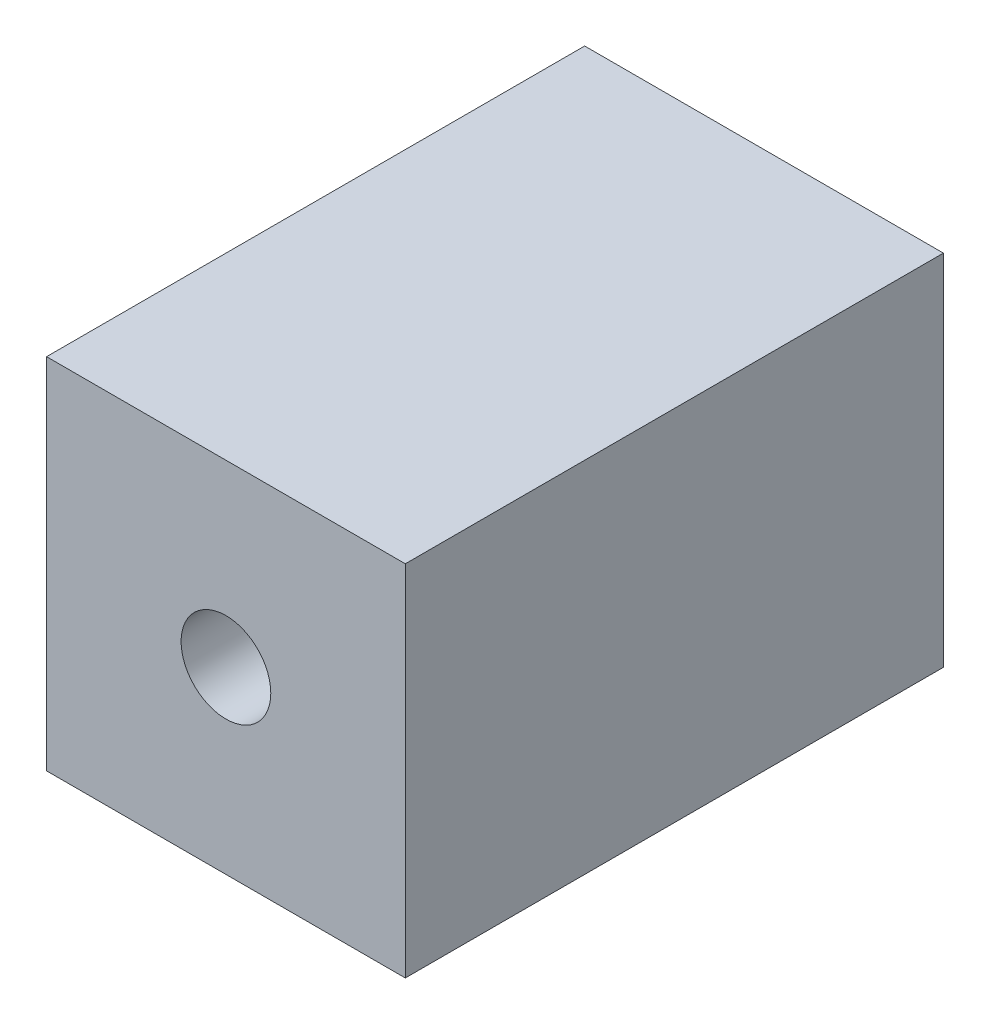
ISO-10303-21;
HEADER;
FILE_DESCRIPTION(('STEP AP214'),'2;1');
FILE_NAME('part.step','',(''),(''),'','','');
FILE_SCHEMA(('AUTOMOTIVE_DESIGN { 1 0 10303 214 1 1 1 1 }'));
ENDSEC;
DATA;
#1=APPLICATION_CONTEXT('core data for automotive mechanical design processes');
#2=APPLICATION_PROTOCOL_DEFINITION('international standard','automotive_design',2000,#1);
#3=PRODUCT_CONTEXT('',#1,'mechanical');
#4=PRODUCT('Part','Part','',(#3));
#5=PRODUCT_RELATED_PRODUCT_CATEGORY('part','',(#4));
#6=PRODUCT_DEFINITION_FORMATION('','',#4);
#7=PRODUCT_DEFINITION_CONTEXT('part definition',#1,'design');
#8=PRODUCT_DEFINITION('design','',#6,#7);
#9=PRODUCT_DEFINITION_SHAPE('','',#8);
#10=(LENGTH_UNIT() NAMED_UNIT(*) SI_UNIT(.MILLI.,.METRE.));
#11=(NAMED_UNIT(*) PLANE_ANGLE_UNIT() SI_UNIT($,.RADIAN.));
#12=(NAMED_UNIT(*) SI_UNIT($,.STERADIAN.) SOLID_ANGLE_UNIT());
#13=UNCERTAINTY_MEASURE_WITH_UNIT(LENGTH_MEASURE(1.E-05),#10,'distance_accuracy_value','');
#14=(GEOMETRIC_REPRESENTATION_CONTEXT(3) GLOBAL_UNCERTAINTY_ASSIGNED_CONTEXT((#13)) GLOBAL_UNIT_ASSIGNED_CONTEXT((#10,
#11,#12)) REPRESENTATION_CONTEXT('',''));
#15=CARTESIAN_POINT('',(0.,0.,0.));
#16=DIRECTION('',(0.,0.,1.));
#17=DIRECTION('',(1.,0.,0.));
#18=AXIS2_PLACEMENT_3D('',#15,#16,#17);
#19=CARTESIAN_POINT('',(0.,0.,30.));
#20=DIRECTION('',(1.,0.,0.));
#21=DIRECTION('',(0.,1.,0.));
#22=AXIS2_PLACEMENT_3D('',#19,#20,#21);
#23=PLANE('',#22);
#24=DIRECTION('',(0.,-1.,0.));
#25=VECTOR('',#24,1.);
#26=CARTESIAN_POINT('',(0.,0.,0.));
#27=LINE('',#26,#25);
#28=CARTESIAN_POINT('',(0.,0.,0.));
#29=VERTEX_POINT('',#28);
#30=CARTESIAN_POINT('',(0.,-20.,0.));
#31=VERTEX_POINT('',#30);
#32=EDGE_CURVE('E107',#29,#31,#27,.T.);
#33=ORIENTED_EDGE('',*,*,#32,.T.);
#34=DIRECTION('',(0.,0.,-1.));
#35=VECTOR('',#34,1.);
#36=CARTESIAN_POINT('',(0.,-20.,30.));
#37=LINE('',#36,#35);
#38=CARTESIAN_POINT('',(0.,-20.,30.));
#39=VERTEX_POINT('',#38);
#40=EDGE_CURVE('E11',#39,#31,#37,.T.);
#41=ORIENTED_EDGE('',*,*,#40,.F.);
#42=DIRECTION('',(0.,-1.,0.));
#43=VECTOR('',#42,1.);
#44=CARTESIAN_POINT('',(0.,0.,30.));
#45=LINE('',#44,#43);
#46=CARTESIAN_POINT('',(0.,0.,30.));
#47=VERTEX_POINT('',#46);
#48=EDGE_CURVE('E91',#47,#39,#45,.T.);
#49=ORIENTED_EDGE('',*,*,#48,.F.);
#50=DIRECTION('',(0.,0.,-1.));
#51=VECTOR('',#50,1.);
#52=CARTESIAN_POINT('',(0.,0.,30.));
#53=LINE('',#52,#51);
#54=EDGE_CURVE('E103',#47,#29,#53,.T.);
#55=ORIENTED_EDGE('',*,*,#54,.T.);
#56=EDGE_LOOP('',(#33,#41,#49,#55));
#57=FACE_BOUND('',#56,.T.);
#58=ADVANCED_FACE('F39',(#57),#23,.F.);
#59=CARTESIAN_POINT('',(0.,-20.,30.));
#60=DIRECTION('',(0.,1.,0.));
#61=DIRECTION('',(0.,0.,1.));
#62=AXIS2_PLACEMENT_3D('',#59,#60,#61);
#63=PLANE('',#62);
#64=DIRECTION('',(1.,0.,0.));
#65=VECTOR('',#64,1.);
#66=CARTESIAN_POINT('',(0.,-20.,0.));
#67=LINE('',#66,#65);
#68=CARTESIAN_POINT('',(20.,-20.,0.));
#69=VERTEX_POINT('',#68);
#70=EDGE_CURVE('E96',#31,#69,#67,.T.);
#71=ORIENTED_EDGE('',*,*,#70,.T.);
#72=DIRECTION('',(0.,0.,-1.));
#73=VECTOR('',#72,1.);
#74=CARTESIAN_POINT('',(20.,-20.,30.));
#75=LINE('',#74,#73);
#76=CARTESIAN_POINT('',(20.,-20.,30.));
#77=VERTEX_POINT('',#76);
#78=EDGE_CURVE('E48',#77,#69,#75,.T.);
#79=ORIENTED_EDGE('',*,*,#78,.F.);
#80=DIRECTION('',(1.,0.,0.));
#81=VECTOR('',#80,1.);
#82=CARTESIAN_POINT('',(0.,-20.,30.));
#83=LINE('',#82,#81);
#84=EDGE_CURVE('E86',#39,#77,#83,.T.);
#85=ORIENTED_EDGE('',*,*,#84,.F.);
#86=ORIENTED_EDGE('',*,*,#40,.T.);
#87=EDGE_LOOP('',(#71,#79,#85,#86));
#88=FACE_BOUND('',#87,.T.);
#89=ADVANCED_FACE('F95',(#88),#63,.F.);
#90=CARTESIAN_POINT('',(20.,0.,30.));
#91=DIRECTION('',(-1.,0.,0.));
#92=DIRECTION('',(0.,-1.,0.));
#93=AXIS2_PLACEMENT_3D('',#90,#91,#92);
#94=PLANE('',#93);
#95=DIRECTION('',(0.,1.,0.));
#96=VECTOR('',#95,1.);
#97=CARTESIAN_POINT('',(20.,0.,0.));
#98=LINE('',#97,#96);
#99=CARTESIAN_POINT('',(20.,0.,0.));
#100=VERTEX_POINT('',#99);
#101=EDGE_CURVE('E73',#69,#100,#98,.T.);
#102=ORIENTED_EDGE('',*,*,#101,.T.);
#103=DIRECTION('',(0.,0.,-1.));
#104=VECTOR('',#103,1.);
#105=CARTESIAN_POINT('',(20.,0.,30.));
#106=LINE('',#105,#104);
#107=CARTESIAN_POINT('',(20.,0.,30.));
#108=VERTEX_POINT('',#107);
#109=EDGE_CURVE('E98',#108,#100,#106,.T.);
#110=ORIENTED_EDGE('',*,*,#109,.F.);
#111=DIRECTION('',(0.,1.,0.));
#112=VECTOR('',#111,1.);
#113=CARTESIAN_POINT('',(20.,0.,30.));
#114=LINE('',#113,#112);
#115=EDGE_CURVE('E89',#77,#108,#114,.T.);
#116=ORIENTED_EDGE('',*,*,#115,.F.);
#117=ORIENTED_EDGE('',*,*,#78,.T.);
#118=EDGE_LOOP('',(#102,#110,#116,#117));
#119=FACE_BOUND('',#118,.T.);
#120=ADVANCED_FACE('F99',(#119),#94,.F.);
#121=CARTESIAN_POINT('',(0.,0.,30.));
#122=DIRECTION('',(0.,-1.,0.));
#123=DIRECTION('',(0.,0.,-1.));
#124=AXIS2_PLACEMENT_3D('',#121,#122,#123);
#125=PLANE('',#124);
#126=DIRECTION('',(-1.,0.,0.));
#127=VECTOR('',#126,1.);
#128=CARTESIAN_POINT('',(0.,0.,0.));
#129=LINE('',#128,#127);
#130=EDGE_CURVE('E79',#100,#29,#129,.T.);
#131=ORIENTED_EDGE('',*,*,#130,.T.);
#132=ORIENTED_EDGE('',*,*,#54,.F.);
#133=DIRECTION('',(-1.,0.,0.));
#134=VECTOR('',#133,1.);
#135=CARTESIAN_POINT('',(0.,0.,30.));
#136=LINE('',#135,#134);
#137=EDGE_CURVE('E56',#108,#47,#136,.T.);
#138=ORIENTED_EDGE('',*,*,#137,.F.);
#139=ORIENTED_EDGE('',*,*,#109,.T.);
#140=EDGE_LOOP('',(#131,#132,#138,#139));
#141=FACE_BOUND('',#140,.T.);
#142=ADVANCED_FACE('F121',(#141),#125,.F.);
#143=CARTESIAN_POINT('',(0.,0.,30.));
#144=DIRECTION('',(0.,0.,1.));
#145=DIRECTION('',(1.,0.,0.));
#146=AXIS2_PLACEMENT_3D('',#143,#144,#145);
#147=PLANE('',#146);
#148=CARTESIAN_POINT('',(10.,-10.,30.));
#149=DIRECTION('',(0.,0.,1.));
#150=DIRECTION('',(1.,0.,0.));
#151=AXIS2_PLACEMENT_3D('',#148,#149,#150);
#152=CIRCLE('',#151,2.5);
#153=CARTESIAN_POINT('',(12.5,-10.,30.));
#154=VERTEX_POINT('',#153);
#155=EDGE_CURVE('E128',#154,#154,#152,.T.);
#156=ORIENTED_EDGE('',*,*,#155,.F.);
#157=EDGE_LOOP('',(#156));
#158=FACE_BOUND('',#157,.T.);
#159=ORIENTED_EDGE('',*,*,#48,.T.);
#160=ORIENTED_EDGE('',*,*,#84,.T.);
#161=ORIENTED_EDGE('',*,*,#115,.T.);
#162=ORIENTED_EDGE('',*,*,#137,.T.);
#163=EDGE_LOOP('',(#159,#160,#161,#162));
#164=FACE_BOUND('',#163,.T.);
#165=ADVANCED_FACE('F87',(#158,#164),#147,.T.);
#166=CARTESIAN_POINT('',(0.,0.,0.));
#167=DIRECTION('',(0.,0.,1.));
#168=DIRECTION('',(1.,0.,0.));
#169=AXIS2_PLACEMENT_3D('',#166,#167,#168);
#170=PLANE('',#169);
#171=ORIENTED_EDGE('',*,*,#32,.F.);
#172=ORIENTED_EDGE('',*,*,#130,.F.);
#173=ORIENTED_EDGE('',*,*,#101,.F.);
#174=ORIENTED_EDGE('',*,*,#70,.F.);
#175=EDGE_LOOP('',(#171,#172,#173,#174));
#176=FACE_BOUND('',#175,.T.);
#177=ADVANCED_FACE('F124',(#176),#170,.F.);
#178=CARTESIAN_POINT('',(10.,-10.,25.));
#179=DIRECTION('',(0.,0.,1.));
#180=DIRECTION('',(1.,0.,0.));
#181=AXIS2_PLACEMENT_3D('',#178,#179,#180);
#182=CYLINDRICAL_SURFACE('',#181,2.5);
#183=CARTESIAN_POINT('',(10.,-10.,25.));
#184=DIRECTION('',(0.,0.,1.));
#185=DIRECTION('',(1.,0.,0.));
#186=AXIS2_PLACEMENT_3D('',#183,#184,#185);
#187=CIRCLE('',#186,2.5);
#188=CARTESIAN_POINT('',(12.5,-10.,25.));
#189=VERTEX_POINT('',#188);
#190=EDGE_CURVE('E111',#189,#189,#187,.T.);
#191=ORIENTED_EDGE('',*,*,#190,.F.);
#192=EDGE_LOOP('',(#191));
#193=FACE_BOUND('',#192,.T.);
#194=ORIENTED_EDGE('',*,*,#155,.T.);
#195=EDGE_LOOP('',(#194));
#196=FACE_BOUND('',#195,.T.);
#197=ADVANCED_FACE('F138',(#193,#196),#182,.F.);
#198=CARTESIAN_POINT('',(10.,-10.,25.));
#199=DIRECTION('',(0.,0.,1.));
#200=DIRECTION('',(1.,0.,0.));
#201=AXIS2_PLACEMENT_3D('',#198,#199,#200);
#202=PLANE('',#201);
#203=ORIENTED_EDGE('',*,*,#190,.T.);
#204=EDGE_LOOP('',(#203));
#205=FACE_BOUND('',#204,.T.);
#206=ADVANCED_FACE('F136',(#205),#202,.T.);
#207=CLOSED_SHELL('',(#58,#89,#120,#142,#165,#177,#197,#206));
#208=MANIFOLD_SOLID_BREP('B2',#207);
#209=ADVANCED_BREP_SHAPE_REPRESENTATION('',(#18,#208),#14);
#210=SHAPE_DEFINITION_REPRESENTATION(#9,#209);
ENDSEC;
END-ISO-10303-21;
